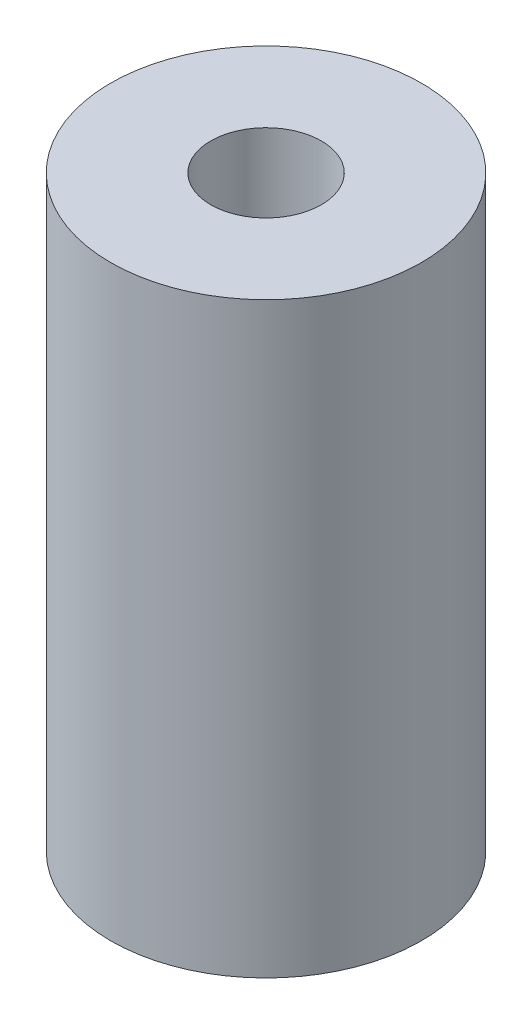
ISO-10303-21;
HEADER;
FILE_DESCRIPTION(('STEP AP214'),'2;1');
FILE_NAME('part.step','',(''),(''),'','','');
FILE_SCHEMA(('AUTOMOTIVE_DESIGN { 1 0 10303 214 1 1 1 1 }'));
ENDSEC;
DATA;
#1=APPLICATION_CONTEXT('core data for automotive mechanical design processes');
#2=APPLICATION_PROTOCOL_DEFINITION('international standard','automotive_design',2000,#1);
#3=PRODUCT_CONTEXT('',#1,'mechanical');
#4=PRODUCT('Part','Part','',(#3));
#5=PRODUCT_RELATED_PRODUCT_CATEGORY('part','',(#4));
#6=PRODUCT_DEFINITION_FORMATION('','',#4);
#7=PRODUCT_DEFINITION_CONTEXT('part definition',#1,'design');
#8=PRODUCT_DEFINITION('design','',#6,#7);
#9=PRODUCT_DEFINITION_SHAPE('','',#8);
#10=(LENGTH_UNIT() NAMED_UNIT(*) SI_UNIT(.MILLI.,.METRE.));
#11=(NAMED_UNIT(*) PLANE_ANGLE_UNIT() SI_UNIT($,.RADIAN.));
#12=(NAMED_UNIT(*) SI_UNIT($,.STERADIAN.) SOLID_ANGLE_UNIT());
#13=UNCERTAINTY_MEASURE_WITH_UNIT(LENGTH_MEASURE(1.E-05),#10,'distance_accuracy_value','');
#14=(GEOMETRIC_REPRESENTATION_CONTEXT(3) GLOBAL_UNCERTAINTY_ASSIGNED_CONTEXT((#13)) GLOBAL_UNIT_ASSIGNED_CONTEXT((#10,
#11,#12)) REPRESENTATION_CONTEXT('',''));
#15=CARTESIAN_POINT('',(0.,0.,0.));
#16=DIRECTION('',(0.,0.,1.));
#17=DIRECTION('',(1.,0.,0.));
#18=AXIS2_PLACEMENT_3D('',#15,#16,#17);
#19=CARTESIAN_POINT('',(0.,12.,0.));
#20=DIRECTION('',(0.,1.,0.));
#21=DIRECTION('',(0.,0.,1.));
#22=AXIS2_PLACEMENT_3D('',#19,#20,#21);
#23=PLANE('',#22);
#24=CARTESIAN_POINT('',(0.,12.,0.));
#25=DIRECTION('',(0.,1.,0.));
#26=DIRECTION('',(0.,0.,1.));
#27=AXIS2_PLACEMENT_3D('',#24,#25,#26);
#28=CIRCLE('',#27,3.175);
#29=CARTESIAN_POINT('',(0.,12.,3.175));
#30=VERTEX_POINT('',#29);
#31=EDGE_CURVE('E10',#30,#30,#28,.T.);
#32=ORIENTED_EDGE('',*,*,#31,.T.);
#33=EDGE_LOOP('',(#32));
#34=FACE_BOUND('',#33,.T.);
#35=CARTESIAN_POINT('',(0.,12.,0.));
#36=DIRECTION('',(0.,1.,0.));
#37=DIRECTION('',(0.,0.,1.));
#38=AXIS2_PLACEMENT_3D('',#35,#36,#37);
#39=CIRCLE('',#38,1.1303);
#40=CARTESIAN_POINT('',(0.,12.,1.1303));
#41=VERTEX_POINT('',#40);
#42=EDGE_CURVE('E41',#41,#41,#39,.T.);
#43=ORIENTED_EDGE('',*,*,#42,.F.);
#44=EDGE_LOOP('',(#43));
#45=FACE_BOUND('',#44,.T.);
#46=ADVANCED_FACE('F30',(#34,#45),#23,.T.);
#47=CARTESIAN_POINT('',(0.,0.,0.));
#48=DIRECTION('',(0.,1.,0.));
#49=DIRECTION('',(0.,0.,1.));
#50=AXIS2_PLACEMENT_3D('',#47,#48,#49);
#51=PLANE('',#50);
#52=CARTESIAN_POINT('',(0.,0.,0.));
#53=DIRECTION('',(0.,1.,0.));
#54=DIRECTION('',(0.,0.,1.));
#55=AXIS2_PLACEMENT_3D('',#52,#53,#54);
#56=CIRCLE('',#55,3.175);
#57=CARTESIAN_POINT('',(0.,0.,3.175));
#58=VERTEX_POINT('',#57);
#59=EDGE_CURVE('E34',#58,#58,#56,.T.);
#60=ORIENTED_EDGE('',*,*,#59,.F.);
#61=EDGE_LOOP('',(#60));
#62=FACE_BOUND('',#61,.T.);
#63=CARTESIAN_POINT('',(0.,0.,0.));
#64=DIRECTION('',(0.,1.,0.));
#65=DIRECTION('',(0.,0.,1.));
#66=AXIS2_PLACEMENT_3D('',#63,#64,#65);
#67=CIRCLE('',#66,1.1303);
#68=CARTESIAN_POINT('',(0.,0.,1.1303));
#69=VERTEX_POINT('',#68);
#70=EDGE_CURVE('E43',#69,#69,#67,.T.);
#71=ORIENTED_EDGE('',*,*,#70,.T.);
#72=EDGE_LOOP('',(#71));
#73=FACE_BOUND('',#72,.T.);
#74=ADVANCED_FACE('F53',(#62,#73),#51,.F.);
#75=CARTESIAN_POINT('',(0.,12.,0.));
#76=DIRECTION('',(0.,-1.,0.));
#77=DIRECTION('',(0.,0.,-1.));
#78=AXIS2_PLACEMENT_3D('',#75,#76,#77);
#79=CYLINDRICAL_SURFACE('',#78,3.175);
#80=ORIENTED_EDGE('',*,*,#31,.F.);
#81=EDGE_LOOP('',(#80));
#82=FACE_BOUND('',#81,.T.);
#83=ORIENTED_EDGE('',*,*,#59,.T.);
#84=EDGE_LOOP('',(#83));
#85=FACE_BOUND('',#84,.T.);
#86=ADVANCED_FACE('F32',(#82,#85),#79,.T.);
#87=CARTESIAN_POINT('',(0.,12.,0.));
#88=DIRECTION('',(0.,-1.,0.));
#89=DIRECTION('',(0.,0.,-1.));
#90=AXIS2_PLACEMENT_3D('',#87,#88,#89);
#91=CYLINDRICAL_SURFACE('',#90,1.1303);
#92=ORIENTED_EDGE('',*,*,#42,.T.);
#93=EDGE_LOOP('',(#92));
#94=FACE_BOUND('',#93,.T.);
#95=ORIENTED_EDGE('',*,*,#70,.F.);
#96=EDGE_LOOP('',(#95));
#97=FACE_BOUND('',#96,.T.);
#98=ADVANCED_FACE('F49',(#94,#97),#91,.F.);
#99=CLOSED_SHELL('',(#46,#74,#86,#98));
#100=MANIFOLD_SOLID_BREP('B2',#99);
#101=ADVANCED_BREP_SHAPE_REPRESENTATION('',(#18,#100),#14);
#102=SHAPE_DEFINITION_REPRESENTATION(#9,#101);
ENDSEC;
END-ISO-10303-21;
